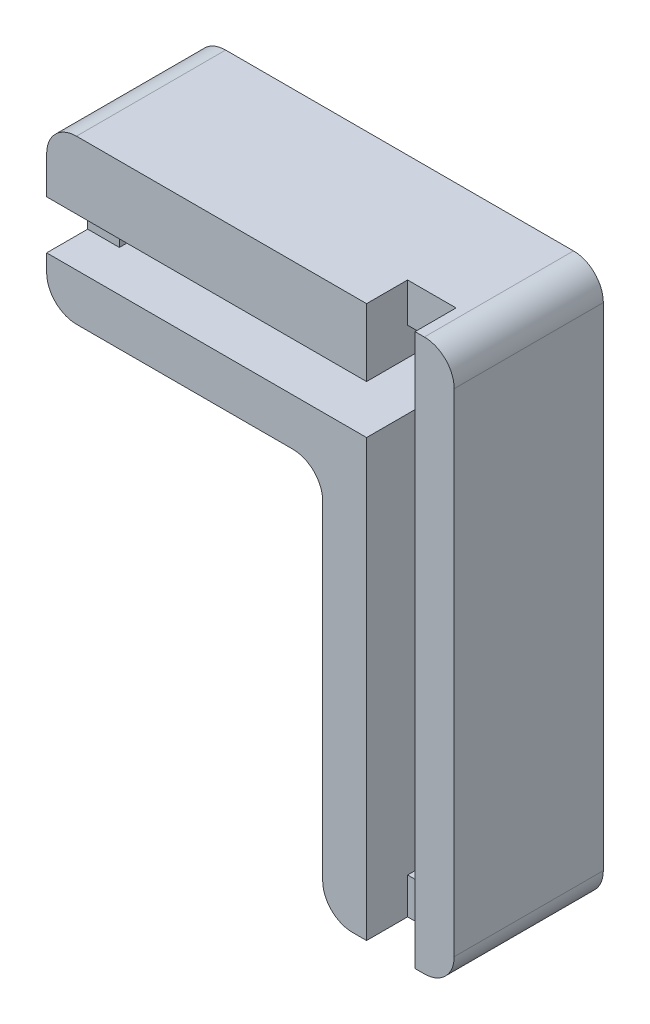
ISO-10303-21;
HEADER;
FILE_DESCRIPTION(('STEP AP214'),'2;1');
FILE_NAME('part.step','',(''),(''),'','','');
FILE_SCHEMA(('AUTOMOTIVE_DESIGN { 1 0 10303 214 1 1 1 1 }'));
ENDSEC;
DATA;
#1=APPLICATION_CONTEXT('core data for automotive mechanical design processes');
#2=APPLICATION_PROTOCOL_DEFINITION('international standard','automotive_design',2000,#1);
#3=PRODUCT_CONTEXT('',#1,'mechanical');
#4=PRODUCT('Part','Part','',(#3));
#5=PRODUCT_RELATED_PRODUCT_CATEGORY('part','',(#4));
#6=PRODUCT_DEFINITION_FORMATION('','',#4);
#7=PRODUCT_DEFINITION_CONTEXT('part definition',#1,'design');
#8=PRODUCT_DEFINITION('design','',#6,#7);
#9=PRODUCT_DEFINITION_SHAPE('','',#8);
#10=(LENGTH_UNIT() NAMED_UNIT(*) SI_UNIT(.MILLI.,.METRE.));
#11=(NAMED_UNIT(*) PLANE_ANGLE_UNIT() SI_UNIT($,.RADIAN.));
#12=(NAMED_UNIT(*) SI_UNIT($,.STERADIAN.) SOLID_ANGLE_UNIT());
#13=UNCERTAINTY_MEASURE_WITH_UNIT(LENGTH_MEASURE(1.E-05),#10,'distance_accuracy_value','');
#14=(GEOMETRIC_REPRESENTATION_CONTEXT(3) GLOBAL_UNCERTAINTY_ASSIGNED_CONTEXT((#13)) GLOBAL_UNIT_ASSIGNED_CONTEXT((#10,
#11,#12)) REPRESENTATION_CONTEXT('',''));
#15=CARTESIAN_POINT('',(0.,0.,0.));
#16=DIRECTION('',(0.,0.,1.));
#17=DIRECTION('',(1.,0.,0.));
#18=AXIS2_PLACEMENT_3D('',#15,#16,#17);
#19=CARTESIAN_POINT('',(0.,0.,20.));
#20=DIRECTION('',(0.,0.,-1.));
#21=DIRECTION('',(-1.,0.,0.));
#22=AXIS2_PLACEMENT_3D('',#19,#20,#21);
#23=PLANE('',#22);
#24=DIRECTION('',(0.,1.,0.));
#25=VECTOR('',#24,1.);
#26=CARTESIAN_POINT('',(54.65,0.,20.));
#27=LINE('',#26,#25);
#28=CARTESIAN_POINT('',(54.65,4.,20.));
#29=VERTEX_POINT('',#28);
#30=CARTESIAN_POINT('',(54.65,69.97,20.));
#31=VERTEX_POINT('',#30);
#32=EDGE_CURVE('E251',#29,#31,#27,.T.);
#33=ORIENTED_EDGE('',*,*,#32,.T.);
#34=CARTESIAN_POINT('',(50.65,69.97,20.));
#35=DIRECTION('',(0.,0.,-1.));
#36=DIRECTION('',(-1.,0.,0.));
#37=AXIS2_PLACEMENT_3D('',#34,#35,#36);
#38=CIRCLE('',#37,4.);
#39=CARTESIAN_POINT('',(50.65,73.97,20.));
#40=VERTEX_POINT('',#39);
#41=EDGE_CURVE('E292',#31,#40,#38,.F.);
#42=ORIENTED_EDGE('',*,*,#41,.T.);
#43=DIRECTION('',(-1.,0.,0.));
#44=VECTOR('',#43,1.);
#45=CARTESIAN_POINT('',(0.,73.97,20.));
#46=LINE('',#45,#44);
#47=CARTESIAN_POINT('',(49.4,73.97,20.));
#48=VERTEX_POINT('',#47);
#49=EDGE_CURVE('E255',#40,#48,#46,.T.);
#50=ORIENTED_EDGE('',*,*,#49,.T.);
#51=DIRECTION('',(0.,-1.,0.));
#52=VECTOR('',#51,1.);
#53=CARTESIAN_POINT('',(49.4,0.,20.));
#54=LINE('',#53,#52);
#55=CARTESIAN_POINT('',(49.4,0.,20.));
#56=VERTEX_POINT('',#55);
#57=EDGE_CURVE('E347',#48,#56,#54,.T.);
#58=ORIENTED_EDGE('',*,*,#57,.T.);
#59=DIRECTION('',(1.,0.,0.));
#60=VECTOR('',#59,1.);
#61=CARTESIAN_POINT('',(0.,0.,20.));
#62=LINE('',#61,#60);
#63=CARTESIAN_POINT('',(50.65,0.,20.));
#64=VERTEX_POINT('',#63);
#65=EDGE_CURVE('E247',#56,#64,#62,.T.);
#66=ORIENTED_EDGE('',*,*,#65,.T.);
#67=CARTESIAN_POINT('',(50.65,4.,20.));
#68=DIRECTION('',(0.,0.,-1.));
#69=DIRECTION('',(-1.,0.,0.));
#70=AXIS2_PLACEMENT_3D('',#67,#68,#69);
#71=CIRCLE('',#70,4.);
#72=EDGE_CURVE('E290',#64,#29,#71,.F.);
#73=ORIENTED_EDGE('',*,*,#72,.T.);
#74=EDGE_LOOP('',(#33,#42,#50,#58,#66,#73));
#75=FACE_BOUND('',#74,.T.);
#76=ADVANCED_FACE('F35',(#75),#23,.F.);
#77=CARTESIAN_POINT('',(42.9,73.97,20.));
#78=VERTEX_POINT('',#77);
#79=CARTESIAN_POINT('',(4.,73.97,20.));
#80=VERTEX_POINT('',#79);
#81=EDGE_CURVE('E254',#78,#80,#46,.T.);
#82=ORIENTED_EDGE('',*,*,#81,.T.);
#83=CARTESIAN_POINT('',(4.,69.97,20.));
#84=DIRECTION('',(0.,0.,-1.));
#85=DIRECTION('',(-1.,0.,0.));
#86=AXIS2_PLACEMENT_3D('',#83,#84,#85);
#87=CIRCLE('',#86,4.);
#88=CARTESIAN_POINT('',(0.,69.97,20.));
#89=VERTEX_POINT('',#88);
#90=EDGE_CURVE('E50',#80,#89,#87,.F.);
#91=ORIENTED_EDGE('',*,*,#90,.T.);
#92=DIRECTION('',(0.,-1.,0.));
#93=VECTOR('',#92,1.);
#94=CARTESIAN_POINT('',(0.,0.,20.));
#95=LINE('',#94,#93);
#96=CARTESIAN_POINT('',(0.,64.92,20.));
#97=VERTEX_POINT('',#96);
#98=EDGE_CURVE('E245',#89,#97,#95,.T.);
#99=ORIENTED_EDGE('',*,*,#98,.T.);
#100=DIRECTION('',(1.,0.,0.));
#101=VECTOR('',#100,1.);
#102=CARTESIAN_POINT('',(0.,64.92,20.));
#103=LINE('',#102,#101);
#104=CARTESIAN_POINT('',(42.9,64.92,20.));
#105=VERTEX_POINT('',#104);
#106=EDGE_CURVE('E369',#97,#105,#103,.T.);
#107=ORIENTED_EDGE('',*,*,#106,.T.);
#108=DIRECTION('',(0.,-1.,0.));
#109=VECTOR('',#108,1.);
#110=CARTESIAN_POINT('',(42.9,0.,20.));
#111=LINE('',#110,#109);
#112=EDGE_CURVE('E349',#78,#105,#111,.T.);
#113=ORIENTED_EDGE('',*,*,#112,.F.);
#114=EDGE_LOOP('',(#82,#91,#99,#107,#113));
#115=FACE_BOUND('',#114,.T.);
#116=ADVANCED_FACE('F486',(#115),#23,.F.);
#117=CARTESIAN_POINT('',(0.,0.,20.));
#118=DIRECTION('',(1.,0.,0.));
#119=DIRECTION('',(0.,0.,-1.));
#120=AXIS2_PLACEMENT_3D('',#117,#118,#119);
#121=PLANE('',#120);
#122=DIRECTION('',(0.,-1.,0.));
#123=VECTOR('',#122,1.);
#124=CARTESIAN_POINT('',(0.,0.,0.));
#125=LINE('',#124,#123);
#126=CARTESIAN_POINT('',(0.,69.97,0.));
#127=VERTEX_POINT('',#126);
#128=CARTESIAN_POINT('',(0.,56.121187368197,0.));
#129=VERTEX_POINT('',#128);
#130=EDGE_CURVE('E258',#127,#129,#125,.T.);
#131=ORIENTED_EDGE('',*,*,#130,.T.);
#132=DIRECTION('',(0.,0.,1.));
#133=VECTOR('',#132,1.);
#134=CARTESIAN_POINT('',(0.,56.121187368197,20.));
#135=LINE('',#134,#133);
#136=CARTESIAN_POINT('',(0.,56.121187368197,20.));
#137=VERTEX_POINT('',#136);
#138=EDGE_CURVE('E314',#129,#137,#135,.T.);
#139=ORIENTED_EDGE('',*,*,#138,.T.);
#140=CARTESIAN_POINT('',(0.,58.42,20.));
#141=VERTEX_POINT('',#140);
#142=EDGE_CURVE('E248',#141,#137,#95,.T.);
#143=ORIENTED_EDGE('',*,*,#142,.F.);
#144=DIRECTION('',(0.,0.,1.));
#145=VECTOR('',#144,1.);
#146=CARTESIAN_POINT('',(0.,58.42,14.5));
#147=LINE('',#146,#145);
#148=CARTESIAN_POINT('',(0.,58.42,14.5));
#149=VERTEX_POINT('',#148);
#150=EDGE_CURVE('E330',#149,#141,#147,.T.);
#151=ORIENTED_EDGE('',*,*,#150,.F.);
#152=DIRECTION('',(0.,-1.,0.));
#153=VECTOR('',#152,1.);
#154=CARTESIAN_POINT('',(0.,64.92,14.5));
#155=LINE('',#154,#153);
#156=CARTESIAN_POINT('',(0.,64.92,14.5));
#157=VERTEX_POINT('',#156);
#158=EDGE_CURVE('E454',#157,#149,#155,.T.);
#159=ORIENTED_EDGE('',*,*,#158,.F.);
#160=DIRECTION('',(0.,0.,1.));
#161=VECTOR('',#160,1.);
#162=CARTESIAN_POINT('',(0.,64.92,14.5));
#163=LINE('',#162,#161);
#164=EDGE_CURVE('E458',#157,#97,#163,.T.);
#165=ORIENTED_EDGE('',*,*,#164,.T.);
#166=ORIENTED_EDGE('',*,*,#98,.F.);
#167=DIRECTION('',(0.,0.,-1.));
#168=VECTOR('',#167,1.);
#169=CARTESIAN_POINT('',(0.,69.97,20.));
#170=LINE('',#169,#168);
#171=EDGE_CURVE('E311',#89,#127,#170,.T.);
#172=ORIENTED_EDGE('',*,*,#171,.T.);
#173=EDGE_LOOP('',(#131,#139,#143,#151,#159,#165,#166,#172));
#174=FACE_BOUND('',#173,.T.);
#175=ADVANCED_FACE('F462',(#174),#121,.F.);
#176=CARTESIAN_POINT('',(0.,0.,20.));
#177=DIRECTION('',(0.,1.,0.));
#178=DIRECTION('',(0.,0.,1.));
#179=AXIS2_PLACEMENT_3D('',#176,#177,#178);
#180=PLANE('',#179);
#181=DIRECTION('',(1.,0.,0.));
#182=VECTOR('',#181,1.);
#183=CARTESIAN_POINT('',(0.,0.,0.));
#184=LINE('',#183,#182);
#185=CARTESIAN_POINT('',(41.0145690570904,0.,0.));
#186=VERTEX_POINT('',#185);
#187=CARTESIAN_POINT('',(50.65,0.,0.));
#188=VERTEX_POINT('',#187);
#189=EDGE_CURVE('E261',#186,#188,#184,.T.);
#190=ORIENTED_EDGE('',*,*,#189,.T.);
#191=DIRECTION('',(0.,0.,-1.));
#192=VECTOR('',#191,1.);
#193=CARTESIAN_POINT('',(50.65,0.,20.));
#194=LINE('',#193,#192);
#195=EDGE_CURVE('E296',#188,#64,#194,.F.);
#196=ORIENTED_EDGE('',*,*,#195,.T.);
#197=ORIENTED_EDGE('',*,*,#65,.F.);
#198=DIRECTION('',(0.,0.,1.));
#199=VECTOR('',#198,1.);
#200=CARTESIAN_POINT('',(49.4,0.,14.5));
#201=LINE('',#200,#199);
#202=CARTESIAN_POINT('',(49.4,0.,14.5));
#203=VERTEX_POINT('',#202);
#204=EDGE_CURVE('E727',#203,#56,#201,.T.);
#205=ORIENTED_EDGE('',*,*,#204,.F.);
#206=DIRECTION('',(1.,0.,0.));
#207=VECTOR('',#206,1.);
#208=CARTESIAN_POINT('',(49.4,0.,14.5));
#209=LINE('',#208,#207);
#210=CARTESIAN_POINT('',(42.9,0.,14.5));
#211=VERTEX_POINT('',#210);
#212=EDGE_CURVE('E222',#211,#203,#209,.T.);
#213=ORIENTED_EDGE('',*,*,#212,.F.);
#214=DIRECTION('',(0.,0.,1.));
#215=VECTOR('',#214,1.);
#216=CARTESIAN_POINT('',(42.9,0.,14.5));
#217=LINE('',#216,#215);
#218=CARTESIAN_POINT('',(42.9,0.,20.));
#219=VERTEX_POINT('',#218);
#220=EDGE_CURVE('E218',#211,#219,#217,.T.);
#221=ORIENTED_EDGE('',*,*,#220,.T.);
#222=CARTESIAN_POINT('',(41.0145690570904,0.,20.));
#223=VERTEX_POINT('',#222);
#224=EDGE_CURVE('E249',#223,#219,#62,.T.);
#225=ORIENTED_EDGE('',*,*,#224,.F.);
#226=DIRECTION('',(0.,0.,1.));
#227=VECTOR('',#226,1.);
#228=CARTESIAN_POINT('',(41.0145690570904,0.,20.));
#229=LINE('',#228,#227);
#230=EDGE_CURVE('E294',#223,#186,#229,.F.);
#231=ORIENTED_EDGE('',*,*,#230,.T.);
#232=EDGE_LOOP('',(#190,#196,#197,#205,#213,#221,#225,#231));
#233=FACE_BOUND('',#232,.T.);
#234=ADVANCED_FACE('F412',(#233),#180,.F.);
#235=CARTESIAN_POINT('',(54.65,0.,20.));
#236=DIRECTION('',(-1.,0.,0.));
#237=DIRECTION('',(0.,-1.,0.));
#238=AXIS2_PLACEMENT_3D('',#235,#236,#237);
#239=PLANE('',#238);
#240=DIRECTION('',(0.,1.,0.));
#241=VECTOR('',#240,1.);
#242=CARTESIAN_POINT('',(54.65,0.,0.));
#243=LINE('',#242,#241);
#244=CARTESIAN_POINT('',(54.65,4.,0.));
#245=VERTEX_POINT('',#244);
#246=CARTESIAN_POINT('',(54.65,69.97,0.));
#247=VERTEX_POINT('',#246);
#248=EDGE_CURVE('E265',#245,#247,#243,.T.);
#249=ORIENTED_EDGE('',*,*,#248,.T.);
#250=DIRECTION('',(0.,0.,-1.));
#251=VECTOR('',#250,1.);
#252=CARTESIAN_POINT('',(54.65,69.97,20.));
#253=LINE('',#252,#251);
#254=EDGE_CURVE('E288',#247,#31,#253,.F.);
#255=ORIENTED_EDGE('',*,*,#254,.T.);
#256=ORIENTED_EDGE('',*,*,#32,.F.);
#257=DIRECTION('',(0.,0.,-1.));
#258=VECTOR('',#257,1.);
#259=CARTESIAN_POINT('',(54.65,4.,20.));
#260=LINE('',#259,#258);
#261=EDGE_CURVE('E285',#29,#245,#260,.T.);
#262=ORIENTED_EDGE('',*,*,#261,.T.);
#263=EDGE_LOOP('',(#249,#255,#256,#262));
#264=FACE_BOUND('',#263,.T.);
#265=ADVANCED_FACE('F429',(#264),#239,.F.);
#266=CARTESIAN_POINT('',(0.,73.97,20.));
#267=DIRECTION('',(0.,-1.,0.));
#268=DIRECTION('',(0.,0.,-1.));
#269=AXIS2_PLACEMENT_3D('',#266,#267,#268);
#270=PLANE('',#269);
#271=ORIENTED_EDGE('',*,*,#49,.F.);
#272=DIRECTION('',(0.,0.,-1.));
#273=VECTOR('',#272,1.);
#274=CARTESIAN_POINT('',(50.65,73.97,20.));
#275=LINE('',#274,#273);
#276=CARTESIAN_POINT('',(50.65,73.97,0.));
#277=VERTEX_POINT('',#276);
#278=EDGE_CURVE('E272',#40,#277,#275,.T.);
#279=ORIENTED_EDGE('',*,*,#278,.T.);
#280=DIRECTION('',(-1.,0.,0.));
#281=VECTOR('',#280,1.);
#282=CARTESIAN_POINT('',(0.,73.97,0.));
#283=LINE('',#282,#281);
#284=CARTESIAN_POINT('',(4.,73.97,0.));
#285=VERTEX_POINT('',#284);
#286=EDGE_CURVE('E268',#277,#285,#283,.T.);
#287=ORIENTED_EDGE('',*,*,#286,.T.);
#288=DIRECTION('',(0.,0.,-1.));
#289=VECTOR('',#288,1.);
#290=CARTESIAN_POINT('',(4.,73.97,20.));
#291=LINE('',#290,#289);
#292=EDGE_CURVE('E257',#285,#80,#291,.F.);
#293=ORIENTED_EDGE('',*,*,#292,.T.);
#294=ORIENTED_EDGE('',*,*,#81,.F.);
#295=DIRECTION('',(0.,0.,1.));
#296=VECTOR('',#295,1.);
#297=CARTESIAN_POINT('',(42.9,73.97,14.5));
#298=LINE('',#297,#296);
#299=CARTESIAN_POINT('',(42.9,73.97,14.5));
#300=VERTEX_POINT('',#299);
#301=EDGE_CURVE('E443',#300,#78,#298,.T.);
#302=ORIENTED_EDGE('',*,*,#301,.F.);
#303=DIRECTION('',(-1.,0.,0.));
#304=VECTOR('',#303,1.);
#305=CARTESIAN_POINT('',(42.9,73.97,14.5));
#306=LINE('',#305,#304);
#307=CARTESIAN_POINT('',(49.4,73.97,14.5));
#308=VERTEX_POINT('',#307);
#309=EDGE_CURVE('E442',#308,#300,#306,.T.);
#310=ORIENTED_EDGE('',*,*,#309,.F.);
#311=DIRECTION('',(0.,0.,1.));
#312=VECTOR('',#311,1.);
#313=CARTESIAN_POINT('',(49.4,73.97,14.5));
#314=LINE('',#313,#312);
#315=EDGE_CURVE('E439',#308,#48,#314,.T.);
#316=ORIENTED_EDGE('',*,*,#315,.T.);
#317=EDGE_LOOP('',(#271,#279,#287,#293,#294,#302,#310,#316));
#318=FACE_BOUND('',#317,.T.);
#319=ADVANCED_FACE('F437',(#318),#270,.F.);
#320=DIRECTION('',(0.,1.,0.));
#321=VECTOR('',#320,1.);
#322=CARTESIAN_POINT('',(37.0145690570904,0.,20.));
#323=LINE('',#322,#321);
#324=CARTESIAN_POINT('',(37.0145690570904,4.,20.));
#325=VERTEX_POINT('',#324);
#326=CARTESIAN_POINT('',(37.0145690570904,48.121187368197,20.));
#327=VERTEX_POINT('',#326);
#328=EDGE_CURVE('E320',#325,#327,#323,.T.);
#329=ORIENTED_EDGE('',*,*,#328,.F.);
#330=CARTESIAN_POINT('',(41.0145690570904,4.,20.));
#331=DIRECTION('',(0.,0.,-1.));
#332=DIRECTION('',(-1.,0.,0.));
#333=AXIS2_PLACEMENT_3D('',#330,#331,#332);
#334=CIRCLE('',#333,4.);
#335=EDGE_CURVE('E304',#325,#223,#334,.F.);
#336=ORIENTED_EDGE('',*,*,#335,.T.);
#337=ORIENTED_EDGE('',*,*,#224,.T.);
#338=CARTESIAN_POINT('',(42.9,58.42,20.));
#339=VERTEX_POINT('',#338);
#340=EDGE_CURVE('E345',#339,#219,#111,.T.);
#341=ORIENTED_EDGE('',*,*,#340,.F.);
#342=DIRECTION('',(1.,0.,0.));
#343=VECTOR('',#342,1.);
#344=CARTESIAN_POINT('',(0.,58.42,20.));
#345=LINE('',#344,#343);
#346=EDGE_CURVE('E356',#141,#339,#345,.T.);
#347=ORIENTED_EDGE('',*,*,#346,.F.);
#348=ORIENTED_EDGE('',*,*,#142,.T.);
#349=CARTESIAN_POINT('',(4.,56.121187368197,20.));
#350=DIRECTION('',(0.,0.,-1.));
#351=DIRECTION('',(-1.,0.,0.));
#352=AXIS2_PLACEMENT_3D('',#349,#350,#351);
#353=CIRCLE('',#352,4.);
#354=CARTESIAN_POINT('',(4.,52.121187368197,20.));
#355=VERTEX_POINT('',#354);
#356=EDGE_CURVE('E58',#137,#355,#353,.F.);
#357=ORIENTED_EDGE('',*,*,#356,.T.);
#358=DIRECTION('',(-1.,0.,0.));
#359=VECTOR('',#358,1.);
#360=CARTESIAN_POINT('',(0.,52.121187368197,20.));
#361=LINE('',#360,#359);
#362=CARTESIAN_POINT('',(33.0145690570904,52.121187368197,20.));
#363=VERTEX_POINT('',#362);
#364=EDGE_CURVE('E321',#363,#355,#361,.T.);
#365=ORIENTED_EDGE('',*,*,#364,.F.);
#366=CARTESIAN_POINT('',(33.0145690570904,48.121187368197,20.));
#367=DIRECTION('',(0.,0.,-1.));
#368=DIRECTION('',(-1.,0.,0.));
#369=AXIS2_PLACEMENT_3D('',#366,#367,#368);
#370=CIRCLE('',#369,4.);
#371=EDGE_CURVE('E43',#363,#327,#370,.T.);
#372=ORIENTED_EDGE('',*,*,#371,.T.);
#373=EDGE_LOOP('',(#329,#336,#337,#341,#347,#348,#357,#365,#372));
#374=FACE_BOUND('',#373,.T.);
#375=ADVANCED_FACE('F319',(#374),#23,.F.);
#376=CARTESIAN_POINT('',(0.,0.,0.));
#377=DIRECTION('',(0.,0.,-1.));
#378=DIRECTION('',(-1.,0.,0.));
#379=AXIS2_PLACEMENT_3D('',#376,#377,#378);
#380=PLANE('',#379);
#381=ORIENTED_EDGE('',*,*,#286,.F.);
#382=CARTESIAN_POINT('',(50.65,69.97,0.));
#383=DIRECTION('',(0.,0.,-1.));
#384=DIRECTION('',(-1.,0.,0.));
#385=AXIS2_PLACEMENT_3D('',#382,#383,#384);
#386=CIRCLE('',#385,4.);
#387=EDGE_CURVE('E283',#277,#247,#386,.T.);
#388=ORIENTED_EDGE('',*,*,#387,.T.);
#389=ORIENTED_EDGE('',*,*,#248,.F.);
#390=CARTESIAN_POINT('',(50.65,4.,0.));
#391=DIRECTION('',(0.,0.,-1.));
#392=DIRECTION('',(-1.,0.,0.));
#393=AXIS2_PLACEMENT_3D('',#390,#391,#392);
#394=CIRCLE('',#393,4.);
#395=EDGE_CURVE('E281',#245,#188,#394,.T.);
#396=ORIENTED_EDGE('',*,*,#395,.T.);
#397=ORIENTED_EDGE('',*,*,#189,.F.);
#398=CARTESIAN_POINT('',(41.0145690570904,4.,0.));
#399=DIRECTION('',(0.,0.,-1.));
#400=DIRECTION('',(-1.,0.,0.));
#401=AXIS2_PLACEMENT_3D('',#398,#399,#400);
#402=CIRCLE('',#401,4.);
#403=CARTESIAN_POINT('',(37.0145690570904,4.,0.));
#404=VERTEX_POINT('',#403);
#405=EDGE_CURVE('E279',#186,#404,#402,.T.);
#406=ORIENTED_EDGE('',*,*,#405,.T.);
#407=DIRECTION('',(0.,1.,0.));
#408=VECTOR('',#407,1.);
#409=CARTESIAN_POINT('',(37.0145690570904,0.,0.));
#410=LINE('',#409,#408);
#411=CARTESIAN_POINT('',(37.0145690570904,48.121187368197,0.));
#412=VERTEX_POINT('',#411);
#413=EDGE_CURVE('E341',#404,#412,#410,.T.);
#414=ORIENTED_EDGE('',*,*,#413,.T.);
#415=CARTESIAN_POINT('',(33.0145690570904,48.121187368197,0.));
#416=DIRECTION('',(0.,0.,-1.));
#417=DIRECTION('',(-1.,0.,0.));
#418=AXIS2_PLACEMENT_3D('',#415,#416,#417);
#419=CIRCLE('',#418,4.);
#420=CARTESIAN_POINT('',(33.0145690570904,52.121187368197,0.));
#421=VERTEX_POINT('',#420);
#422=EDGE_CURVE('E11',#412,#421,#419,.F.);
#423=ORIENTED_EDGE('',*,*,#422,.T.);
#424=DIRECTION('',(-1.,0.,0.));
#425=VECTOR('',#424,1.);
#426=CARTESIAN_POINT('',(0.,52.121187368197,0.));
#427=LINE('',#426,#425);
#428=CARTESIAN_POINT('',(4.,52.121187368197,0.));
#429=VERTEX_POINT('',#428);
#430=EDGE_CURVE('E339',#421,#429,#427,.T.);
#431=ORIENTED_EDGE('',*,*,#430,.T.);
#432=CARTESIAN_POINT('',(4.,56.121187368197,0.));
#433=DIRECTION('',(0.,0.,-1.));
#434=DIRECTION('',(-1.,0.,0.));
#435=AXIS2_PLACEMENT_3D('',#432,#433,#434);
#436=CIRCLE('',#435,4.);
#437=EDGE_CURVE('E277',#429,#129,#436,.T.);
#438=ORIENTED_EDGE('',*,*,#437,.T.);
#439=ORIENTED_EDGE('',*,*,#130,.F.);
#440=CARTESIAN_POINT('',(4.,69.97,0.));
#441=DIRECTION('',(0.,0.,-1.));
#442=DIRECTION('',(-1.,0.,0.));
#443=AXIS2_PLACEMENT_3D('',#440,#441,#442);
#444=CIRCLE('',#443,4.);
#445=EDGE_CURVE('E275',#127,#285,#444,.T.);
#446=ORIENTED_EDGE('',*,*,#445,.T.);
#447=EDGE_LOOP('',(#381,#388,#389,#396,#397,#406,#414,#423,#431,#438,#439,#446));
#448=FACE_BOUND('',#447,.T.);
#449=ADVANCED_FACE('F338',(#448),#380,.T.);
#450=CARTESIAN_POINT('',(42.9,0.,5.));
#451=DIRECTION('',(-1.,0.,0.));
#452=DIRECTION('',(0.,0.,1.));
#453=AXIS2_PLACEMENT_3D('',#450,#451,#452);
#454=PLANE('',#453);
#455=ORIENTED_EDGE('',*,*,#340,.T.);
#456=ORIENTED_EDGE('',*,*,#220,.F.);
#457=DIRECTION('',(0.,-1.,0.));
#458=VECTOR('',#457,1.);
#459=CARTESIAN_POINT('',(42.9,4.86999999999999,14.5));
#460=LINE('',#459,#458);
#461=CARTESIAN_POINT('',(42.9,4.86999999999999,14.5));
#462=VERTEX_POINT('',#461);
#463=EDGE_CURVE('E209',#462,#211,#460,.T.);
#464=ORIENTED_EDGE('',*,*,#463,.F.);
#465=DIRECTION('',(0.,0.,1.));
#466=VECTOR('',#465,1.);
#467=CARTESIAN_POINT('',(42.9,4.86999999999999,5.));
#468=LINE('',#467,#466);
#469=CARTESIAN_POINT('',(42.9,4.86999999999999,5.));
#470=VERTEX_POINT('',#469);
#471=EDGE_CURVE('E215',#470,#462,#468,.T.);
#472=ORIENTED_EDGE('',*,*,#471,.F.);
#473=DIRECTION('',(0.,-1.,0.));
#474=VECTOR('',#473,1.);
#475=CARTESIAN_POINT('',(42.9,0.,5.));
#476=LINE('',#475,#474);
#477=CARTESIAN_POINT('',(42.9,58.42,5.));
#478=VERTEX_POINT('',#477);
#479=EDGE_CURVE('E354',#478,#470,#476,.T.);
#480=ORIENTED_EDGE('',*,*,#479,.F.);
#481=DIRECTION('',(0.,0.,1.));
#482=VECTOR('',#481,1.);
#483=CARTESIAN_POINT('',(42.9,58.42,5.));
#484=LINE('',#483,#482);
#485=EDGE_CURVE('E262',#478,#339,#484,.T.);
#486=ORIENTED_EDGE('',*,*,#485,.T.);
#487=EDGE_LOOP('',(#455,#456,#464,#472,#480,#486));
#488=FACE_BOUND('',#487,.T.);
#489=ADVANCED_FACE('F212',(#488),#454,.F.);
#490=CARTESIAN_POINT('',(0.,58.42,5.));
#491=DIRECTION('',(0.,-1.,0.));
#492=DIRECTION('',(1.,0.,0.));
#493=AXIS2_PLACEMENT_3D('',#490,#491,#492);
#494=PLANE('',#493);
#495=ORIENTED_EDGE('',*,*,#346,.T.);
#496=ORIENTED_EDGE('',*,*,#485,.F.);
#497=DIRECTION('',(1.,0.,0.));
#498=VECTOR('',#497,1.);
#499=CARTESIAN_POINT('',(0.,58.42,5.));
#500=LINE('',#499,#498);
#501=CARTESIAN_POINT('',(4.25,58.42,5.));
#502=VERTEX_POINT('',#501);
#503=EDGE_CURVE('E236',#502,#478,#500,.T.);
#504=ORIENTED_EDGE('',*,*,#503,.F.);
#505=DIRECTION('',(0.,0.,1.));
#506=VECTOR('',#505,1.);
#507=CARTESIAN_POINT('',(4.25,58.42,5.));
#508=LINE('',#507,#506);
#509=CARTESIAN_POINT('',(4.25,58.42,14.5));
#510=VERTEX_POINT('',#509);
#511=EDGE_CURVE('E375',#502,#510,#508,.T.);
#512=ORIENTED_EDGE('',*,*,#511,.T.);
#513=DIRECTION('',(1.,0.,0.));
#514=VECTOR('',#513,1.);
#515=CARTESIAN_POINT('',(4.25,58.42,14.5));
#516=LINE('',#515,#514);
#517=EDGE_CURVE('E456',#149,#510,#516,.T.);
#518=ORIENTED_EDGE('',*,*,#517,.F.);
#519=ORIENTED_EDGE('',*,*,#150,.T.);
#520=EDGE_LOOP('',(#495,#496,#504,#512,#518,#519));
#521=FACE_BOUND('',#520,.T.);
#522=ADVANCED_FACE('F405',(#521),#494,.F.);
#523=CARTESIAN_POINT('',(4.25000000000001,0.,5.));
#524=DIRECTION('',(-1.,0.,0.));
#525=DIRECTION('',(0.,-1.,0.));
#526=AXIS2_PLACEMENT_3D('',#523,#524,#525);
#527=PLANE('',#526);
#528=DIRECTION('',(0.,0.,1.));
#529=VECTOR('',#528,1.);
#530=CARTESIAN_POINT('',(4.25,64.92,5.));
#531=LINE('',#530,#529);
#532=CARTESIAN_POINT('',(4.25,64.92,5.));
#533=VERTEX_POINT('',#532);
#534=CARTESIAN_POINT('',(4.25,64.92,14.5));
#535=VERTEX_POINT('',#534);
#536=EDGE_CURVE('E378',#533,#535,#531,.T.);
#537=ORIENTED_EDGE('',*,*,#536,.T.);
#538=DIRECTION('',(0.,1.,0.));
#539=VECTOR('',#538,1.);
#540=CARTESIAN_POINT('',(4.25,64.92,14.5));
#541=LINE('',#540,#539);
#542=EDGE_CURVE('E446',#510,#535,#541,.T.);
#543=ORIENTED_EDGE('',*,*,#542,.F.);
#544=ORIENTED_EDGE('',*,*,#511,.F.);
#545=DIRECTION('',(0.,-1.,0.));
#546=VECTOR('',#545,1.);
#547=CARTESIAN_POINT('',(4.25000000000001,0.,5.));
#548=LINE('',#547,#546);
#549=EDGE_CURVE('E241',#533,#502,#548,.T.);
#550=ORIENTED_EDGE('',*,*,#549,.F.);
#551=EDGE_LOOP('',(#537,#543,#544,#550));
#552=FACE_BOUND('',#551,.T.);
#553=ADVANCED_FACE('F472',(#552),#527,.F.);
#554=CARTESIAN_POINT('',(0.,64.92,5.));
#555=DIRECTION('',(0.,-1.,0.));
#556=DIRECTION('',(1.,0.,0.));
#557=AXIS2_PLACEMENT_3D('',#554,#555,#556);
#558=PLANE('',#557);
#559=ORIENTED_EDGE('',*,*,#106,.F.);
#560=ORIENTED_EDGE('',*,*,#164,.F.);
#561=DIRECTION('',(-1.,0.,0.));
#562=VECTOR('',#561,1.);
#563=CARTESIAN_POINT('',(4.25,64.92,14.5));
#564=LINE('',#563,#562);
#565=EDGE_CURVE('E451',#535,#157,#564,.T.);
#566=ORIENTED_EDGE('',*,*,#565,.F.);
#567=ORIENTED_EDGE('',*,*,#536,.F.);
#568=DIRECTION('',(1.,0.,0.));
#569=VECTOR('',#568,1.);
#570=CARTESIAN_POINT('',(0.,64.92,5.));
#571=LINE('',#570,#569);
#572=CARTESIAN_POINT('',(42.9,64.92,5.));
#573=VERTEX_POINT('',#572);
#574=EDGE_CURVE('E364',#533,#573,#571,.T.);
#575=ORIENTED_EDGE('',*,*,#574,.T.);
#576=DIRECTION('',(0.,0.,1.));
#577=VECTOR('',#576,1.);
#578=CARTESIAN_POINT('',(42.9,64.92,5.));
#579=LINE('',#578,#577);
#580=EDGE_CURVE('E381',#573,#105,#579,.T.);
#581=ORIENTED_EDGE('',*,*,#580,.T.);
#582=EDGE_LOOP('',(#559,#560,#566,#567,#575,#581));
#583=FACE_BOUND('',#582,.T.);
#584=ADVANCED_FACE('F467',(#583),#558,.T.);
#585=ORIENTED_EDGE('',*,*,#112,.T.);
#586=ORIENTED_EDGE('',*,*,#580,.F.);
#587=CARTESIAN_POINT('',(42.9,68.72,5.));
#588=VERTEX_POINT('',#587);
#589=EDGE_CURVE('E357',#588,#573,#476,.T.);
#590=ORIENTED_EDGE('',*,*,#589,.F.);
#591=DIRECTION('',(0.,0.,1.));
#592=VECTOR('',#591,1.);
#593=CARTESIAN_POINT('',(42.9,68.72,5.));
#594=LINE('',#593,#592);
#595=CARTESIAN_POINT('',(42.9,68.72,14.5));
#596=VERTEX_POINT('',#595);
#597=EDGE_CURVE('E383',#588,#596,#594,.T.);
#598=ORIENTED_EDGE('',*,*,#597,.T.);
#599=DIRECTION('',(0.,-1.,0.));
#600=VECTOR('',#599,1.);
#601=CARTESIAN_POINT('',(42.9,68.72,14.5));
#602=LINE('',#601,#600);
#603=EDGE_CURVE('E726',#300,#596,#602,.T.);
#604=ORIENTED_EDGE('',*,*,#603,.F.);
#605=ORIENTED_EDGE('',*,*,#301,.T.);
#606=EDGE_LOOP('',(#585,#586,#590,#598,#604,#605));
#607=FACE_BOUND('',#606,.T.);
#608=ADVANCED_FACE('F636',(#607),#454,.F.);
#609=CARTESIAN_POINT('',(0.,68.72,5.));
#610=DIRECTION('',(0.,1.,0.));
#611=DIRECTION('',(0.,0.,1.));
#612=AXIS2_PLACEMENT_3D('',#609,#610,#611);
#613=PLANE('',#612);
#614=DIRECTION('',(0.,0.,1.));
#615=VECTOR('',#614,1.);
#616=CARTESIAN_POINT('',(49.4,68.72,5.));
#617=LINE('',#616,#615);
#618=CARTESIAN_POINT('',(49.4,68.72,5.));
#619=VERTEX_POINT('',#618);
#620=CARTESIAN_POINT('',(49.4,68.72,14.5));
#621=VERTEX_POINT('',#620);
#622=EDGE_CURVE('E238',#619,#621,#617,.T.);
#623=ORIENTED_EDGE('',*,*,#622,.T.);
#624=DIRECTION('',(1.,0.,0.));
#625=VECTOR('',#624,1.);
#626=CARTESIAN_POINT('',(42.9,68.72,14.5));
#627=LINE('',#626,#625);
#628=EDGE_CURVE('E390',#596,#621,#627,.T.);
#629=ORIENTED_EDGE('',*,*,#628,.F.);
#630=ORIENTED_EDGE('',*,*,#597,.F.);
#631=DIRECTION('',(-1.,0.,0.));
#632=VECTOR('',#631,1.);
#633=CARTESIAN_POINT('',(0.,68.72,5.));
#634=LINE('',#633,#632);
#635=EDGE_CURVE('E361',#619,#588,#634,.T.);
#636=ORIENTED_EDGE('',*,*,#635,.F.);
#637=EDGE_LOOP('',(#623,#629,#630,#636));
#638=FACE_BOUND('',#637,.T.);
#639=ADVANCED_FACE('F389',(#638),#613,.F.);
#640=CARTESIAN_POINT('',(49.4,0.,5.));
#641=DIRECTION('',(-1.,0.,0.));
#642=DIRECTION('',(0.,0.,1.));
#643=AXIS2_PLACEMENT_3D('',#640,#641,#642);
#644=PLANE('',#643);
#645=ORIENTED_EDGE('',*,*,#57,.F.);
#646=ORIENTED_EDGE('',*,*,#315,.F.);
#647=DIRECTION('',(0.,1.,0.));
#648=VECTOR('',#647,1.);
#649=CARTESIAN_POINT('',(49.4,68.72,14.5));
#650=LINE('',#649,#648);
#651=EDGE_CURVE('E397',#621,#308,#650,.T.);
#652=ORIENTED_EDGE('',*,*,#651,.F.);
#653=ORIENTED_EDGE('',*,*,#622,.F.);
#654=DIRECTION('',(0.,-1.,0.));
#655=VECTOR('',#654,1.);
#656=CARTESIAN_POINT('',(49.4,0.,5.));
#657=LINE('',#656,#655);
#658=CARTESIAN_POINT('',(49.4,4.86999999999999,5.));
#659=VERTEX_POINT('',#658);
#660=EDGE_CURVE('E359',#619,#659,#657,.T.);
#661=ORIENTED_EDGE('',*,*,#660,.T.);
#662=DIRECTION('',(0.,0.,1.));
#663=VECTOR('',#662,1.);
#664=CARTESIAN_POINT('',(49.4,4.86999999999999,5.));
#665=LINE('',#664,#663);
#666=CARTESIAN_POINT('',(49.4,4.86999999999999,14.5));
#667=VERTEX_POINT('',#666);
#668=EDGE_CURVE('E235',#659,#667,#665,.T.);
#669=ORIENTED_EDGE('',*,*,#668,.T.);
#670=DIRECTION('',(0.,1.,0.));
#671=VECTOR('',#670,1.);
#672=CARTESIAN_POINT('',(49.4,4.86999999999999,14.5));
#673=LINE('',#672,#671);
#674=EDGE_CURVE('E227',#203,#667,#673,.T.);
#675=ORIENTED_EDGE('',*,*,#674,.F.);
#676=ORIENTED_EDGE('',*,*,#204,.T.);
#677=EDGE_LOOP('',(#645,#646,#652,#653,#661,#669,#675,#676));
#678=FACE_BOUND('',#677,.T.);
#679=ADVANCED_FACE('F395',(#678),#644,.T.);
#680=CARTESIAN_POINT('',(0.,4.86999999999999,5.));
#681=DIRECTION('',(0.,1.,0.));
#682=DIRECTION('',(0.,0.,1.));
#683=AXIS2_PLACEMENT_3D('',#680,#681,#682);
#684=PLANE('',#683);
#685=DIRECTION('',(-1.,0.,0.));
#686=VECTOR('',#685,1.);
#687=CARTESIAN_POINT('',(49.4,4.86999999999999,14.5));
#688=LINE('',#687,#686);
#689=EDGE_CURVE('E223',#667,#462,#688,.T.);
#690=ORIENTED_EDGE('',*,*,#689,.F.);
#691=ORIENTED_EDGE('',*,*,#668,.F.);
#692=DIRECTION('',(-1.,0.,0.));
#693=VECTOR('',#692,1.);
#694=CARTESIAN_POINT('',(0.,4.86999999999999,5.));
#695=LINE('',#694,#693);
#696=EDGE_CURVE('E234',#659,#470,#695,.T.);
#697=ORIENTED_EDGE('',*,*,#696,.T.);
#698=ORIENTED_EDGE('',*,*,#471,.T.);
#699=EDGE_LOOP('',(#690,#691,#697,#698));
#700=FACE_BOUND('',#699,.T.);
#701=ADVANCED_FACE('F232',(#700),#684,.T.);
#702=CARTESIAN_POINT('',(0.,0.,5.));
#703=DIRECTION('',(0.,0.,1.));
#704=DIRECTION('',(1.,0.,0.));
#705=AXIS2_PLACEMENT_3D('',#702,#703,#704);
#706=PLANE('',#705);
#707=ORIENTED_EDGE('',*,*,#479,.T.);
#708=ORIENTED_EDGE('',*,*,#696,.F.);
#709=ORIENTED_EDGE('',*,*,#660,.F.);
#710=ORIENTED_EDGE('',*,*,#635,.T.);
#711=ORIENTED_EDGE('',*,*,#589,.T.);
#712=ORIENTED_EDGE('',*,*,#574,.F.);
#713=ORIENTED_EDGE('',*,*,#549,.T.);
#714=ORIENTED_EDGE('',*,*,#503,.T.);
#715=EDGE_LOOP('',(#707,#708,#709,#710,#711,#712,#713,#714));
#716=FACE_BOUND('',#715,.T.);
#717=ADVANCED_FACE('F399',(#716),#706,.T.);
#718=CARTESIAN_POINT('',(0.,52.121187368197,0.));
#719=DIRECTION('',(0.,1.,0.));
#720=DIRECTION('',(0.,0.,1.));
#721=AXIS2_PLACEMENT_3D('',#718,#719,#720);
#722=PLANE('',#721);
#723=ORIENTED_EDGE('',*,*,#430,.F.);
#724=DIRECTION('',(0.,0.,1.));
#725=VECTOR('',#724,1.);
#726=CARTESIAN_POINT('',(33.0145690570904,52.121187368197,20.));
#727=LINE('',#726,#725);
#728=EDGE_CURVE('E308',#421,#363,#727,.T.);
#729=ORIENTED_EDGE('',*,*,#728,.T.);
#730=ORIENTED_EDGE('',*,*,#364,.T.);
#731=DIRECTION('',(0.,0.,1.));
#732=VECTOR('',#731,1.);
#733=CARTESIAN_POINT('',(4.,52.121187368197,0.));
#734=LINE('',#733,#732);
#735=EDGE_CURVE('E306',#355,#429,#734,.F.);
#736=ORIENTED_EDGE('',*,*,#735,.T.);
#737=EDGE_LOOP('',(#723,#729,#730,#736));
#738=FACE_BOUND('',#737,.T.);
#739=ADVANCED_FACE('F343',(#738),#722,.F.);
#740=CARTESIAN_POINT('',(37.0145690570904,0.,0.));
#741=DIRECTION('',(1.,0.,0.));
#742=DIRECTION('',(0.,0.,-1.));
#743=AXIS2_PLACEMENT_3D('',#740,#741,#742);
#744=PLANE('',#743);
#745=ORIENTED_EDGE('',*,*,#413,.F.);
#746=DIRECTION('',(0.,0.,1.));
#747=VECTOR('',#746,1.);
#748=CARTESIAN_POINT('',(37.0145690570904,4.,0.));
#749=LINE('',#748,#747);
#750=EDGE_CURVE('E300',#404,#325,#749,.T.);
#751=ORIENTED_EDGE('',*,*,#750,.T.);
#752=ORIENTED_EDGE('',*,*,#328,.T.);
#753=DIRECTION('',(0.,0.,1.));
#754=VECTOR('',#753,1.);
#755=CARTESIAN_POINT('',(37.0145690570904,48.121187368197,0.));
#756=LINE('',#755,#754);
#757=EDGE_CURVE('E298',#327,#412,#756,.F.);
#758=ORIENTED_EDGE('',*,*,#757,.T.);
#759=EDGE_LOOP('',(#745,#751,#752,#758));
#760=FACE_BOUND('',#759,.T.);
#761=ADVANCED_FACE('F327',(#760),#744,.F.);
#762=CARTESIAN_POINT('',(0.,0.,14.5));
#763=DIRECTION('',(0.,0.,-1.));
#764=DIRECTION('',(-1.,0.,0.));
#765=AXIS2_PLACEMENT_3D('',#762,#763,#764);
#766=PLANE('',#765);
#767=ORIENTED_EDGE('',*,*,#542,.T.);
#768=ORIENTED_EDGE('',*,*,#565,.T.);
#769=ORIENTED_EDGE('',*,*,#158,.T.);
#770=ORIENTED_EDGE('',*,*,#517,.T.);
#771=EDGE_LOOP('',(#767,#768,#769,#770));
#772=FACE_BOUND('',#771,.T.);
#773=ADVANCED_FACE('F469',(#772),#766,.F.);
#774=CARTESIAN_POINT('',(0.,0.,14.5));
#775=DIRECTION('',(0.,0.,-1.));
#776=DIRECTION('',(-1.,0.,0.));
#777=AXIS2_PLACEMENT_3D('',#774,#775,#776);
#778=PLANE('',#777);
#779=ORIENTED_EDGE('',*,*,#603,.T.);
#780=ORIENTED_EDGE('',*,*,#628,.T.);
#781=ORIENTED_EDGE('',*,*,#651,.T.);
#782=ORIENTED_EDGE('',*,*,#309,.T.);
#783=EDGE_LOOP('',(#779,#780,#781,#782));
#784=FACE_BOUND('',#783,.T.);
#785=ADVANCED_FACE('F554',(#784),#778,.F.);
#786=CARTESIAN_POINT('',(0.,0.,14.5));
#787=DIRECTION('',(0.,0.,-1.));
#788=DIRECTION('',(-1.,0.,0.));
#789=AXIS2_PLACEMENT_3D('',#786,#787,#788);
#790=PLANE('',#789);
#791=ORIENTED_EDGE('',*,*,#674,.T.);
#792=ORIENTED_EDGE('',*,*,#689,.T.);
#793=ORIENTED_EDGE('',*,*,#463,.T.);
#794=ORIENTED_EDGE('',*,*,#212,.T.);
#795=EDGE_LOOP('',(#791,#792,#793,#794));
#796=FACE_BOUND('',#795,.T.);
#797=ADVANCED_FACE('F226',(#796),#790,.F.);
#798=CARTESIAN_POINT('',(50.65,69.97,20.));
#799=DIRECTION('',(0.,0.,-1.));
#800=DIRECTION('',(-1.,0.,0.));
#801=AXIS2_PLACEMENT_3D('',#798,#799,#800);
#802=CYLINDRICAL_SURFACE('',#801,4.);
#803=ORIENTED_EDGE('',*,*,#41,.F.);
#804=ORIENTED_EDGE('',*,*,#254,.F.);
#805=ORIENTED_EDGE('',*,*,#387,.F.);
#806=ORIENTED_EDGE('',*,*,#278,.F.);
#807=EDGE_LOOP('',(#803,#804,#805,#806));
#808=FACE_BOUND('',#807,.T.);
#809=ADVANCED_FACE('F432',(#808),#802,.T.);
#810=CARTESIAN_POINT('',(50.65,4.,20.));
#811=DIRECTION('',(0.,0.,-1.));
#812=DIRECTION('',(-1.,0.,0.));
#813=AXIS2_PLACEMENT_3D('',#810,#811,#812);
#814=CYLINDRICAL_SURFACE('',#813,4.);
#815=ORIENTED_EDGE('',*,*,#72,.F.);
#816=ORIENTED_EDGE('',*,*,#195,.F.);
#817=ORIENTED_EDGE('',*,*,#395,.F.);
#818=ORIENTED_EDGE('',*,*,#261,.F.);
#819=EDGE_LOOP('',(#815,#816,#817,#818));
#820=FACE_BOUND('',#819,.T.);
#821=ADVANCED_FACE('F423',(#820),#814,.T.);
#822=CARTESIAN_POINT('',(41.0145690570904,4.,0.));
#823=DIRECTION('',(0.,0.,1.));
#824=DIRECTION('',(1.,0.,0.));
#825=AXIS2_PLACEMENT_3D('',#822,#823,#824);
#826=CYLINDRICAL_SURFACE('',#825,4.);
#827=ORIENTED_EDGE('',*,*,#405,.F.);
#828=ORIENTED_EDGE('',*,*,#230,.F.);
#829=ORIENTED_EDGE('',*,*,#335,.F.);
#830=ORIENTED_EDGE('',*,*,#750,.F.);
#831=EDGE_LOOP('',(#827,#828,#829,#830));
#832=FACE_BOUND('',#831,.T.);
#833=ADVANCED_FACE('F416',(#832),#826,.T.);
#834=CARTESIAN_POINT('',(33.0145690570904,48.121187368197,0.));
#835=DIRECTION('',(0.,0.,-1.));
#836=DIRECTION('',(-1.,0.,0.));
#837=AXIS2_PLACEMENT_3D('',#834,#835,#836);
#838=CYLINDRICAL_SURFACE('',#837,4.);
#839=ORIENTED_EDGE('',*,*,#422,.F.);
#840=ORIENTED_EDGE('',*,*,#757,.F.);
#841=ORIENTED_EDGE('',*,*,#371,.F.);
#842=ORIENTED_EDGE('',*,*,#728,.F.);
#843=EDGE_LOOP('',(#839,#840,#841,#842));
#844=FACE_BOUND('',#843,.T.);
#845=ADVANCED_FACE('F333',(#844),#838,.F.);
#846=CARTESIAN_POINT('',(4.,56.121187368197,20.));
#847=DIRECTION('',(0.,0.,1.));
#848=DIRECTION('',(1.,0.,0.));
#849=AXIS2_PLACEMENT_3D('',#846,#847,#848);
#850=CYLINDRICAL_SURFACE('',#849,4.);
#851=ORIENTED_EDGE('',*,*,#437,.F.);
#852=ORIENTED_EDGE('',*,*,#735,.F.);
#853=ORIENTED_EDGE('',*,*,#356,.F.);
#854=ORIENTED_EDGE('',*,*,#138,.F.);
#855=EDGE_LOOP('',(#851,#852,#853,#854));
#856=FACE_BOUND('',#855,.T.);
#857=ADVANCED_FACE('F477',(#856),#850,.T.);
#858=CARTESIAN_POINT('',(4.,69.97,20.));
#859=DIRECTION('',(0.,0.,-1.));
#860=DIRECTION('',(-1.,0.,0.));
#861=AXIS2_PLACEMENT_3D('',#858,#859,#860);
#862=CYLINDRICAL_SURFACE('',#861,4.);
#863=ORIENTED_EDGE('',*,*,#90,.F.);
#864=ORIENTED_EDGE('',*,*,#292,.F.);
#865=ORIENTED_EDGE('',*,*,#445,.F.);
#866=ORIENTED_EDGE('',*,*,#171,.F.);
#867=EDGE_LOOP('',(#863,#864,#865,#866));
#868=FACE_BOUND('',#867,.T.);
#869=ADVANCED_FACE('F37',(#868),#862,.T.);
#870=CLOSED_SHELL('',(#76,#116,#175,#234,#265,#319,#375,#449,#489,#522,#553,#584,#608,#639,#679,
#701,#717,#739,#761,#773,#785,#797,#809,#821,#833,#845,#857,#869));
#871=MANIFOLD_SOLID_BREP('B2',#870);
#872=ADVANCED_BREP_SHAPE_REPRESENTATION('',(#18,#871),#14);
#873=SHAPE_DEFINITION_REPRESENTATION(#9,#872);
ENDSEC;
END-ISO-10303-21;
